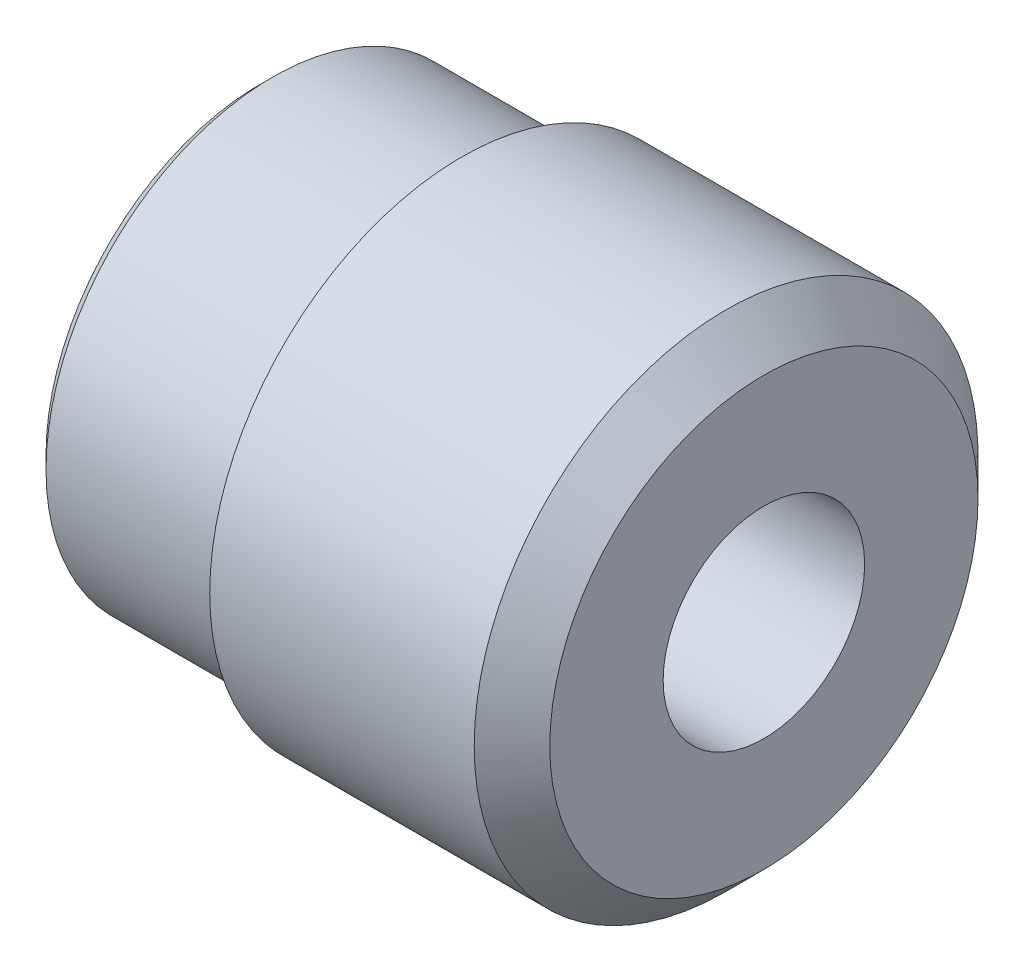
from build123d import *

# Parameters (mm, degrees)
CHANFREIN1_SIZE = 1.5
CHANFREIN2_SIZE = 0.5


with BuildPart() as part:
    # Esquisse1 → Base-R_volution (revolve)
    with BuildSketch(Plane.XY, mode=Mode.PRIVATE) as base_r_volution_sk:
        Polygon((0, 6), (-14, 6), (-14, 9), (-6, 9), (-6, 10), (6, 10), (6, 4), (0, 4), align=None)
    revolve(base_r_volution_sk.sketch.rotate(Axis((-32.238461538, 0, 0), (1, 0, 0)), 90), axis=Axis((-32.238461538, 0, 0), (1, 0, 0)))

    # Chanfrein1
    chanfrein1_edges = [part.edges().sort_by_distance(p)[0] for p in [
        (6, 0, -10),
    ]]
    chamfer(chanfrein1_edges, length=CHANFREIN1_SIZE)

    # Chanfrein2
    chanfrein2_edges = [part.edges().sort_by_distance(p)[0] for p in [
        (-14, 0, -9),
    ]]
    chamfer(chanfrein2_edges, length=CHANFREIN2_SIZE)


solid = part.part
